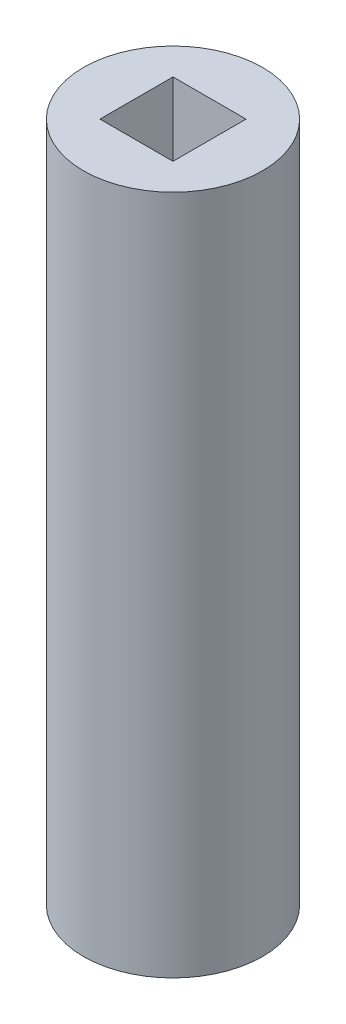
ISO-10303-21;
HEADER;
FILE_DESCRIPTION(('STEP AP214'),'2;1');
FILE_NAME('part.step','',(''),(''),'','','');
FILE_SCHEMA(('AUTOMOTIVE_DESIGN { 1 0 10303 214 1 1 1 1 }'));
ENDSEC;
DATA;
#1=APPLICATION_CONTEXT('core data for automotive mechanical design processes');
#2=APPLICATION_PROTOCOL_DEFINITION('international standard','automotive_design',2000,#1);
#3=PRODUCT_CONTEXT('',#1,'mechanical');
#4=PRODUCT('Part','Part','',(#3));
#5=PRODUCT_RELATED_PRODUCT_CATEGORY('part','',(#4));
#6=PRODUCT_DEFINITION_FORMATION('','',#4);
#7=PRODUCT_DEFINITION_CONTEXT('part definition',#1,'design');
#8=PRODUCT_DEFINITION('design','',#6,#7);
#9=PRODUCT_DEFINITION_SHAPE('','',#8);
#10=(LENGTH_UNIT() NAMED_UNIT(*) SI_UNIT(.MILLI.,.METRE.));
#11=(NAMED_UNIT(*) PLANE_ANGLE_UNIT() SI_UNIT($,.RADIAN.));
#12=(NAMED_UNIT(*) SI_UNIT($,.STERADIAN.) SOLID_ANGLE_UNIT());
#13=UNCERTAINTY_MEASURE_WITH_UNIT(LENGTH_MEASURE(1.E-05),#10,'distance_accuracy_value','');
#14=(GEOMETRIC_REPRESENTATION_CONTEXT(3) GLOBAL_UNCERTAINTY_ASSIGNED_CONTEXT((#13)) GLOBAL_UNIT_ASSIGNED_CONTEXT((#10,
#11,#12)) REPRESENTATION_CONTEXT('',''));
#15=CARTESIAN_POINT('',(0.,0.,0.));
#16=DIRECTION('',(0.,0.,1.));
#17=DIRECTION('',(1.,0.,0.));
#18=AXIS2_PLACEMENT_3D('',#15,#16,#17);
#19=CARTESIAN_POINT('',(0.,95.,0.));
#20=DIRECTION('',(0.,1.,0.));
#21=DIRECTION('',(0.,0.,1.));
#22=AXIS2_PLACEMENT_3D('',#19,#20,#21);
#23=PLANE('',#22);
#24=CARTESIAN_POINT('',(0.,95.,0.));
#25=DIRECTION('',(0.,1.,0.));
#26=DIRECTION('',(0.,0.,1.));
#27=AXIS2_PLACEMENT_3D('',#24,#25,#26);
#28=CIRCLE('',#27,12.5);
#29=CARTESIAN_POINT('',(0.,95.,12.5));
#30=VERTEX_POINT('',#29);
#31=EDGE_CURVE('E11',#30,#30,#28,.T.);
#32=ORIENTED_EDGE('',*,*,#31,.T.);
#33=EDGE_LOOP('',(#32));
#34=FACE_BOUND('',#33,.T.);
#35=DIRECTION('',(1.,0.,0.));
#36=VECTOR('',#35,1.);
#37=CARTESIAN_POINT('',(5.1,95.,5.1));
#38=LINE('',#37,#36);
#39=CARTESIAN_POINT('',(-5.1,95.,5.1));
#40=VERTEX_POINT('',#39);
#41=CARTESIAN_POINT('',(5.1,95.,5.1));
#42=VERTEX_POINT('',#41);
#43=EDGE_CURVE('E84',#40,#42,#38,.T.);
#44=ORIENTED_EDGE('',*,*,#43,.F.);
#45=DIRECTION('',(0.,0.,1.));
#46=VECTOR('',#45,1.);
#47=CARTESIAN_POINT('',(-5.1,95.,5.1));
#48=LINE('',#47,#46);
#49=CARTESIAN_POINT('',(-5.1,95.,-5.1));
#50=VERTEX_POINT('',#49);
#51=EDGE_CURVE('E76',#50,#40,#48,.T.);
#52=ORIENTED_EDGE('',*,*,#51,.F.);
#53=DIRECTION('',(-1.,0.,0.));
#54=VECTOR('',#53,1.);
#55=CARTESIAN_POINT('',(5.1,95.,-5.1));
#56=LINE('',#55,#54);
#57=CARTESIAN_POINT('',(5.1,95.,-5.1));
#58=VERTEX_POINT('',#57);
#59=EDGE_CURVE('E97',#58,#50,#56,.T.);
#60=ORIENTED_EDGE('',*,*,#59,.F.);
#61=DIRECTION('',(0.,0.,-1.));
#62=VECTOR('',#61,1.);
#63=CARTESIAN_POINT('',(5.1,95.,5.1));
#64=LINE('',#63,#62);
#65=EDGE_CURVE('E95',#42,#58,#64,.T.);
#66=ORIENTED_EDGE('',*,*,#65,.F.);
#67=EDGE_LOOP('',(#44,#52,#60,#66));
#68=FACE_BOUND('',#67,.T.);
#69=ADVANCED_FACE('F35',(#34,#68),#23,.T.);
#70=CARTESIAN_POINT('',(0.,0.,0.));
#71=DIRECTION('',(0.,1.,0.));
#72=DIRECTION('',(0.,0.,1.));
#73=AXIS2_PLACEMENT_3D('',#70,#71,#72);
#74=PLANE('',#73);
#75=CARTESIAN_POINT('',(0.,0.,0.));
#76=DIRECTION('',(0.,1.,0.));
#77=DIRECTION('',(0.,0.,1.));
#78=AXIS2_PLACEMENT_3D('',#75,#76,#77);
#79=CIRCLE('',#78,12.5);
#80=CARTESIAN_POINT('',(0.,0.,12.5));
#81=VERTEX_POINT('',#80);
#82=EDGE_CURVE('E39',#81,#81,#79,.T.);
#83=ORIENTED_EDGE('',*,*,#82,.F.);
#84=EDGE_LOOP('',(#83));
#85=FACE_BOUND('',#84,.T.);
#86=DIRECTION('',(0.,0.,1.));
#87=VECTOR('',#86,1.);
#88=CARTESIAN_POINT('',(-5.1,0.,5.1));
#89=LINE('',#88,#87);
#90=CARTESIAN_POINT('',(-5.1,0.,-5.1));
#91=VERTEX_POINT('',#90);
#92=CARTESIAN_POINT('',(-5.1,0.,5.1));
#93=VERTEX_POINT('',#92);
#94=EDGE_CURVE('E58',#91,#93,#89,.T.);
#95=ORIENTED_EDGE('',*,*,#94,.T.);
#96=DIRECTION('',(1.,0.,0.));
#97=VECTOR('',#96,1.);
#98=CARTESIAN_POINT('',(5.1,0.,5.1));
#99=LINE('',#98,#97);
#100=CARTESIAN_POINT('',(5.1,0.,5.1));
#101=VERTEX_POINT('',#100);
#102=EDGE_CURVE('E91',#93,#101,#99,.T.);
#103=ORIENTED_EDGE('',*,*,#102,.T.);
#104=DIRECTION('',(0.,0.,-1.));
#105=VECTOR('',#104,1.);
#106=CARTESIAN_POINT('',(5.1,0.,5.1));
#107=LINE('',#106,#105);
#108=CARTESIAN_POINT('',(5.1,0.,-5.1));
#109=VERTEX_POINT('',#108);
#110=EDGE_CURVE('E103',#101,#109,#107,.T.);
#111=ORIENTED_EDGE('',*,*,#110,.T.);
#112=DIRECTION('',(-1.,0.,0.));
#113=VECTOR('',#112,1.);
#114=CARTESIAN_POINT('',(5.1,0.,-5.1));
#115=LINE('',#114,#113);
#116=EDGE_CURVE('E85',#109,#91,#115,.T.);
#117=ORIENTED_EDGE('',*,*,#116,.T.);
#118=EDGE_LOOP('',(#95,#103,#111,#117));
#119=FACE_BOUND('',#118,.T.);
#120=ADVANCED_FACE('F114',(#85,#119),#74,.F.);
#121=CARTESIAN_POINT('',(0.,95.,0.));
#122=DIRECTION('',(0.,-1.,0.));
#123=DIRECTION('',(0.,0.,-1.));
#124=AXIS2_PLACEMENT_3D('',#121,#122,#123);
#125=CYLINDRICAL_SURFACE('',#124,12.5);
#126=ORIENTED_EDGE('',*,*,#31,.F.);
#127=EDGE_LOOP('',(#126));
#128=FACE_BOUND('',#127,.T.);
#129=ORIENTED_EDGE('',*,*,#82,.T.);
#130=EDGE_LOOP('',(#129));
#131=FACE_BOUND('',#130,.T.);
#132=ADVANCED_FACE('F37',(#128,#131),#125,.T.);
#133=CARTESIAN_POINT('',(-5.1,95.,5.1));
#134=DIRECTION('',(1.,0.,0.));
#135=DIRECTION('',(0.,0.,-1.));
#136=AXIS2_PLACEMENT_3D('',#133,#134,#135);
#137=PLANE('',#136);
#138=ORIENTED_EDGE('',*,*,#94,.F.);
#139=DIRECTION('',(0.,-1.,0.));
#140=VECTOR('',#139,1.);
#141=CARTESIAN_POINT('',(-5.1,95.,-5.1));
#142=LINE('',#141,#140);
#143=EDGE_CURVE('E80',#50,#91,#142,.T.);
#144=ORIENTED_EDGE('',*,*,#143,.F.);
#145=ORIENTED_EDGE('',*,*,#51,.T.);
#146=DIRECTION('',(0.,-1.,0.));
#147=VECTOR('',#146,1.);
#148=CARTESIAN_POINT('',(-5.1,95.,5.1));
#149=LINE('',#148,#147);
#150=EDGE_CURVE('E79',#40,#93,#149,.T.);
#151=ORIENTED_EDGE('',*,*,#150,.T.);
#152=EDGE_LOOP('',(#138,#144,#145,#151));
#153=FACE_BOUND('',#152,.T.);
#154=ADVANCED_FACE('F78',(#153),#137,.T.);
#155=CARTESIAN_POINT('',(5.1,95.,5.1));
#156=DIRECTION('',(0.,0.,-1.));
#157=DIRECTION('',(-1.,0.,0.));
#158=AXIS2_PLACEMENT_3D('',#155,#156,#157);
#159=PLANE('',#158);
#160=ORIENTED_EDGE('',*,*,#102,.F.);
#161=ORIENTED_EDGE('',*,*,#150,.F.);
#162=ORIENTED_EDGE('',*,*,#43,.T.);
#163=DIRECTION('',(0.,-1.,0.));
#164=VECTOR('',#163,1.);
#165=CARTESIAN_POINT('',(5.1,95.,5.1));
#166=LINE('',#165,#164);
#167=EDGE_CURVE('E92',#42,#101,#166,.T.);
#168=ORIENTED_EDGE('',*,*,#167,.T.);
#169=EDGE_LOOP('',(#160,#161,#162,#168));
#170=FACE_BOUND('',#169,.T.);
#171=ADVANCED_FACE('F88',(#170),#159,.T.);
#172=CARTESIAN_POINT('',(5.1,95.,5.1));
#173=DIRECTION('',(-1.,0.,0.));
#174=DIRECTION('',(0.,0.,1.));
#175=AXIS2_PLACEMENT_3D('',#172,#173,#174);
#176=PLANE('',#175);
#177=ORIENTED_EDGE('',*,*,#110,.F.);
#178=ORIENTED_EDGE('',*,*,#167,.F.);
#179=ORIENTED_EDGE('',*,*,#65,.T.);
#180=DIRECTION('',(0.,-1.,0.));
#181=VECTOR('',#180,1.);
#182=CARTESIAN_POINT('',(5.1,95.,-5.1));
#183=LINE('',#182,#181);
#184=EDGE_CURVE('E50',#58,#109,#183,.T.);
#185=ORIENTED_EDGE('',*,*,#184,.T.);
#186=EDGE_LOOP('',(#177,#178,#179,#185));
#187=FACE_BOUND('',#186,.T.);
#188=ADVANCED_FACE('F112',(#187),#176,.T.);
#189=CARTESIAN_POINT('',(5.1,95.,-5.1));
#190=DIRECTION('',(0.,0.,1.));
#191=DIRECTION('',(1.,0.,0.));
#192=AXIS2_PLACEMENT_3D('',#189,#190,#191);
#193=PLANE('',#192);
#194=ORIENTED_EDGE('',*,*,#116,.F.);
#195=ORIENTED_EDGE('',*,*,#184,.F.);
#196=ORIENTED_EDGE('',*,*,#59,.T.);
#197=ORIENTED_EDGE('',*,*,#143,.T.);
#198=EDGE_LOOP('',(#194,#195,#196,#197));
#199=FACE_BOUND('',#198,.T.);
#200=ADVANCED_FACE('F115',(#199),#193,.T.);
#201=CLOSED_SHELL('',(#69,#120,#132,#154,#171,#188,#200));
#202=MANIFOLD_SOLID_BREP('B2',#201);
#203=ADVANCED_BREP_SHAPE_REPRESENTATION('',(#18,#202),#14);
#204=SHAPE_DEFINITION_REPRESENTATION(#9,#203);
ENDSEC;
END-ISO-10303-21;
